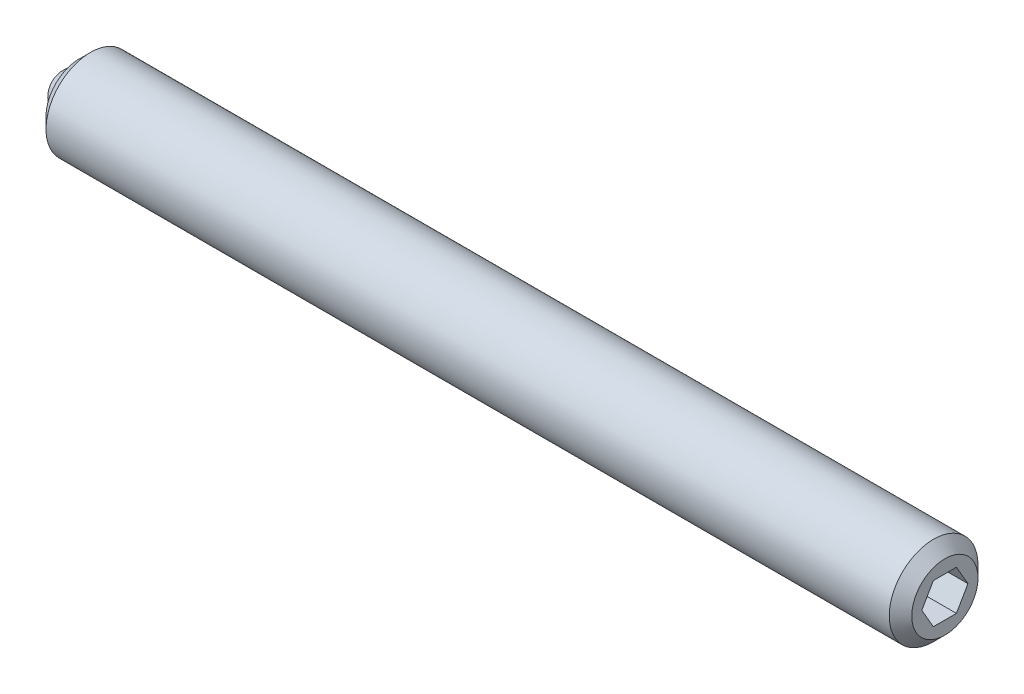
from build123d import *

# Parameters (mm, degrees)
SKETCH2_R           = 1
BOSS_EXTRUDE1_DEPTH = 19.5
CHAMFER1_SIZE       = 0.254
CHAMFER2_SIZE       = 0.254
CUT_EXTRUDE2_DEPTH  = 2
SKETCH3_R           = 0.5
CUT_EXTRUDE3_DEPTH  = 0.5


with BuildPart() as part:
    # Sketch2 → Boss-Extrude1 (new body)
    with BuildSketch(Plane(origin=(0, 0, 0), x_dir=(0, 0, -1), z_dir=(1, 0, 0))):
        Circle(SKETCH2_R)
    extrude(amount=BOSS_EXTRUDE1_DEPTH)

    # Chamfer1
    chamfer1_edges = [part.edges().sort_by_distance(p)[0] for p in [
        (0, 0, 1),
    ]]
    chamfer(chamfer1_edges, length=CHAMFER1_SIZE)

    # Chamfer2
    chamfer2_edges = [part.edges().sort_by_distance(p)[0] for p in [
        (19.5, 0, 1),
    ]]
    chamfer(chamfer2_edges, length=CHAMFER2_SIZE)

    # Sketch4 → Cut-Extrude2 (cut)
    with BuildSketch(Plane(origin=(19.5, 0, 0), x_dir=(0, 0, -1), z_dir=(1, 0, 0))):
        Polygon((0.519615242, 0), (0.259807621, 0.45), (-0.259807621, 0.45), (-0.519615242, 0), (-0.259807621, -0.45), (0.259807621, -0.45), align=None)
    extrude(amount=-CUT_EXTRUDE2_DEPTH, mode=Mode.SUBTRACT)

    # Sketch3 → Cut-Extrude3 (cut)
    with BuildSketch(Plane.ZY):
        Circle(SKETCH3_R)
    extrude(amount=-CUT_EXTRUDE3_DEPTH, mode=Mode.SUBTRACT)


with BuildPart() as body_2:
    # Sketch5 → Revolve1 (revolve)
    with BuildSketch(Plane.ZY):
        with BuildLine():
            Line((0, 0), (0, -0.5))
            ThreePointArc((0, -0.5), (-0.5, 0), (0, 0.5))
            Line((0, 0.5), (0, 0))
        make_face()
    revolve(axis=Axis((0, 0, 0), (0, 1, 0)))


solid = Compound([part.part, body_2.part])
